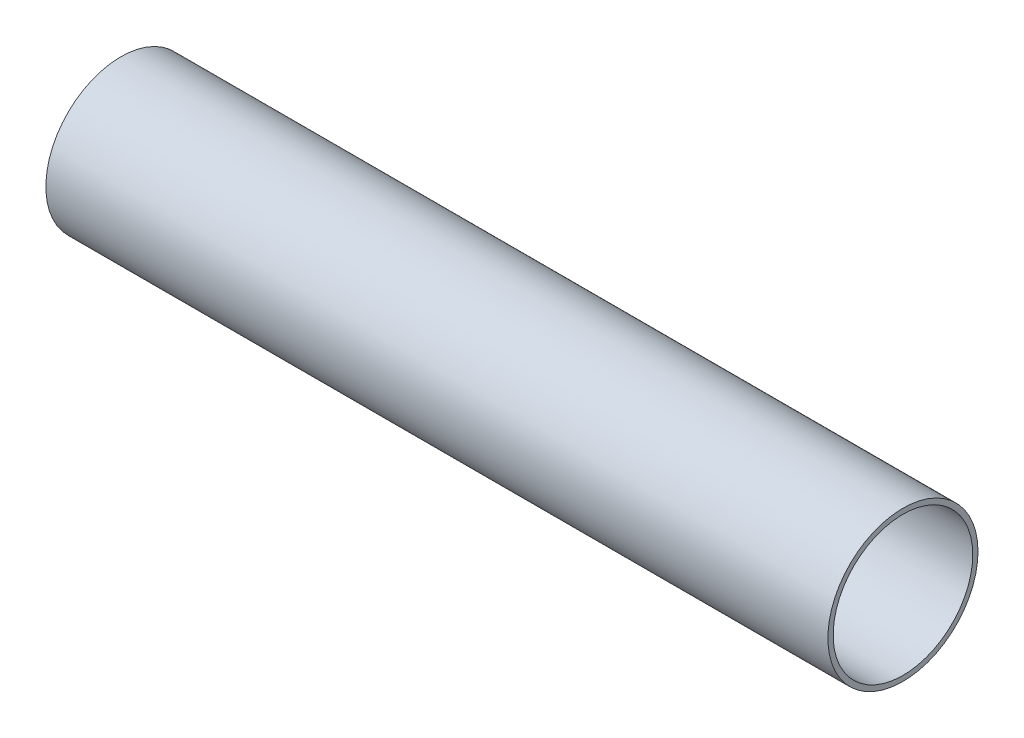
ISO-10303-21;
HEADER;
FILE_DESCRIPTION(('STEP AP214'),'2;1');
FILE_NAME('part.step','',(''),(''),'','','');
FILE_SCHEMA(('AUTOMOTIVE_DESIGN { 1 0 10303 214 1 1 1 1 }'));
ENDSEC;
DATA;
#1=APPLICATION_CONTEXT('core data for automotive mechanical design processes');
#2=APPLICATION_PROTOCOL_DEFINITION('international standard','automotive_design',2000,#1);
#3=PRODUCT_CONTEXT('',#1,'mechanical');
#4=PRODUCT('Part','Part','',(#3));
#5=PRODUCT_RELATED_PRODUCT_CATEGORY('part','',(#4));
#6=PRODUCT_DEFINITION_FORMATION('','',#4);
#7=PRODUCT_DEFINITION_CONTEXT('part definition',#1,'design');
#8=PRODUCT_DEFINITION('design','',#6,#7);
#9=PRODUCT_DEFINITION_SHAPE('','',#8);
#10=(LENGTH_UNIT() NAMED_UNIT(*) SI_UNIT(.MILLI.,.METRE.));
#11=(NAMED_UNIT(*) PLANE_ANGLE_UNIT() SI_UNIT($,.RADIAN.));
#12=(NAMED_UNIT(*) SI_UNIT($,.STERADIAN.) SOLID_ANGLE_UNIT());
#13=UNCERTAINTY_MEASURE_WITH_UNIT(LENGTH_MEASURE(1.E-05),#10,'distance_accuracy_value','');
#14=(GEOMETRIC_REPRESENTATION_CONTEXT(3) GLOBAL_UNCERTAINTY_ASSIGNED_CONTEXT((#13)) GLOBAL_UNIT_ASSIGNED_CONTEXT((#10,
#11,#12)) REPRESENTATION_CONTEXT('',''));
#15=CARTESIAN_POINT('',(0.,0.,0.));
#16=DIRECTION('',(0.,0.,1.));
#17=DIRECTION('',(1.,0.,0.));
#18=AXIS2_PLACEMENT_3D('',#15,#16,#17);
#19=CARTESIAN_POINT('',(303.022,0.,0.));
#20=DIRECTION('',(1.,0.,0.));
#21=DIRECTION('',(0.,0.,-1.));
#22=AXIS2_PLACEMENT_3D('',#19,#20,#21);
#23=PLANE('',#22);
#24=CARTESIAN_POINT('',(303.022,0.,0.));
#25=DIRECTION('',(1.,0.,0.));
#26=DIRECTION('',(0.,0.,-1.));
#27=AXIS2_PLACEMENT_3D('',#24,#25,#26);
#28=CIRCLE('',#27,29.083);
#29=CARTESIAN_POINT('',(303.022,0.,-29.083));
#30=VERTEX_POINT('',#29);
#31=EDGE_CURVE('E10',#30,#30,#28,.T.);
#32=ORIENTED_EDGE('',*,*,#31,.T.);
#33=EDGE_LOOP('',(#32));
#34=FACE_BOUND('',#33,.T.);
#35=CARTESIAN_POINT('',(303.022,0.,0.));
#36=DIRECTION('',(1.,0.,0.));
#37=DIRECTION('',(0.,0.,-1.));
#38=AXIS2_PLACEMENT_3D('',#35,#36,#37);
#39=CIRCLE('',#38,27.051);
#40=CARTESIAN_POINT('',(303.022,0.,-27.051));
#41=VERTEX_POINT('',#40);
#42=EDGE_CURVE('E40',#41,#41,#39,.T.);
#43=ORIENTED_EDGE('',*,*,#42,.F.);
#44=EDGE_LOOP('',(#43));
#45=FACE_BOUND('',#44,.T.);
#46=ADVANCED_FACE('F29',(#34,#45),#23,.T.);
#47=CARTESIAN_POINT('',(0.,0.,0.));
#48=DIRECTION('',(1.,0.,0.));
#49=DIRECTION('',(0.,0.,-1.));
#50=AXIS2_PLACEMENT_3D('',#47,#48,#49);
#51=PLANE('',#50);
#52=CARTESIAN_POINT('',(0.,0.,0.));
#53=DIRECTION('',(1.,0.,0.));
#54=DIRECTION('',(0.,0.,-1.));
#55=AXIS2_PLACEMENT_3D('',#52,#53,#54);
#56=CIRCLE('',#55,29.083);
#57=CARTESIAN_POINT('',(0.,0.,-29.083));
#58=VERTEX_POINT('',#57);
#59=EDGE_CURVE('E36',#58,#58,#56,.T.);
#60=ORIENTED_EDGE('',*,*,#59,.F.);
#61=EDGE_LOOP('',(#60));
#62=FACE_BOUND('',#61,.T.);
#63=CARTESIAN_POINT('',(0.,0.,0.));
#64=DIRECTION('',(1.,0.,0.));
#65=DIRECTION('',(0.,0.,-1.));
#66=AXIS2_PLACEMENT_3D('',#63,#64,#65);
#67=CIRCLE('',#66,27.051);
#68=CARTESIAN_POINT('',(0.,0.,-27.051));
#69=VERTEX_POINT('',#68);
#70=EDGE_CURVE('E44',#69,#69,#67,.T.);
#71=ORIENTED_EDGE('',*,*,#70,.T.);
#72=EDGE_LOOP('',(#71));
#73=FACE_BOUND('',#72,.T.);
#74=ADVANCED_FACE('F50',(#62,#73),#51,.F.);
#75=CARTESIAN_POINT('',(303.022,0.,0.));
#76=DIRECTION('',(-1.,0.,0.));
#77=DIRECTION('',(0.,0.,1.));
#78=AXIS2_PLACEMENT_3D('',#75,#76,#77);
#79=CYLINDRICAL_SURFACE('',#78,29.083);
#80=ORIENTED_EDGE('',*,*,#31,.F.);
#81=EDGE_LOOP('',(#80));
#82=FACE_BOUND('',#81,.T.);
#83=ORIENTED_EDGE('',*,*,#59,.T.);
#84=EDGE_LOOP('',(#83));
#85=FACE_BOUND('',#84,.T.);
#86=ADVANCED_FACE('F31',(#82,#85),#79,.T.);
#87=CARTESIAN_POINT('',(303.022,0.,0.));
#88=DIRECTION('',(-1.,0.,0.));
#89=DIRECTION('',(0.,0.,1.));
#90=AXIS2_PLACEMENT_3D('',#87,#88,#89);
#91=CYLINDRICAL_SURFACE('',#90,27.051);
#92=ORIENTED_EDGE('',*,*,#42,.T.);
#93=EDGE_LOOP('',(#92));
#94=FACE_BOUND('',#93,.T.);
#95=ORIENTED_EDGE('',*,*,#70,.F.);
#96=EDGE_LOOP('',(#95));
#97=FACE_BOUND('',#96,.T.);
#98=ADVANCED_FACE('F52',(#94,#97),#91,.F.);
#99=CLOSED_SHELL('',(#46,#74,#86,#98));
#100=MANIFOLD_SOLID_BREP('B2',#99);
#101=ADVANCED_BREP_SHAPE_REPRESENTATION('',(#18,#100),#14);
#102=SHAPE_DEFINITION_REPRESENTATION(#9,#101);
ENDSEC;
END-ISO-10303-21;
